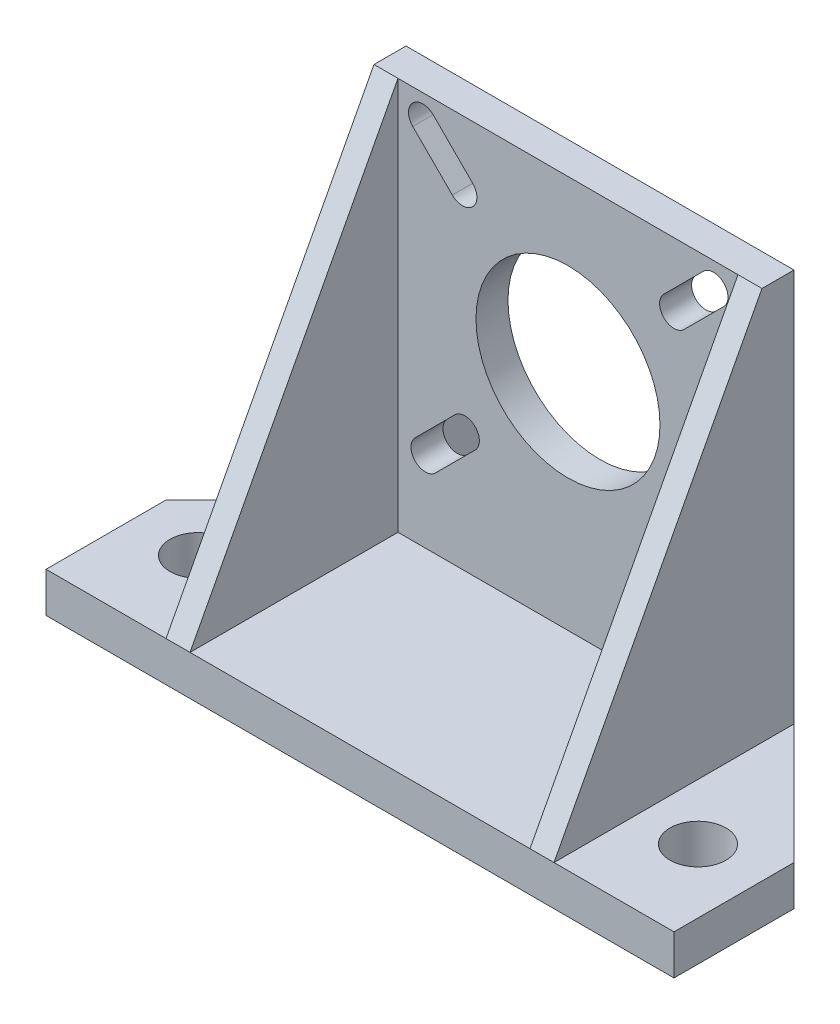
ISO-10303-21;
HEADER;
FILE_DESCRIPTION(('STEP AP214'),'2;1');
FILE_NAME('part.step','',(''),(''),'','','');
FILE_SCHEMA(('AUTOMOTIVE_DESIGN { 1 0 10303 214 1 1 1 1 }'));
ENDSEC;
DATA;
#1=APPLICATION_CONTEXT('core data for automotive mechanical design processes');
#2=APPLICATION_PROTOCOL_DEFINITION('international standard','automotive_design',2000,#1);
#3=PRODUCT_CONTEXT('',#1,'mechanical');
#4=PRODUCT('Part','Part','',(#3));
#5=PRODUCT_RELATED_PRODUCT_CATEGORY('part','',(#4));
#6=PRODUCT_DEFINITION_FORMATION('','',#4);
#7=PRODUCT_DEFINITION_CONTEXT('part definition',#1,'design');
#8=PRODUCT_DEFINITION('design','',#6,#7);
#9=PRODUCT_DEFINITION_SHAPE('','',#8);
#10=(LENGTH_UNIT() NAMED_UNIT(*) SI_UNIT(.MILLI.,.METRE.));
#11=(NAMED_UNIT(*) PLANE_ANGLE_UNIT() SI_UNIT($,.RADIAN.));
#12=(NAMED_UNIT(*) SI_UNIT($,.STERADIAN.) SOLID_ANGLE_UNIT());
#13=UNCERTAINTY_MEASURE_WITH_UNIT(LENGTH_MEASURE(1.E-05),#10,'distance_accuracy_value','');
#14=(GEOMETRIC_REPRESENTATION_CONTEXT(3) GLOBAL_UNCERTAINTY_ASSIGNED_CONTEXT((#13)) GLOBAL_UNIT_ASSIGNED_CONTEXT((#10,
#11,#12)) REPRESENTATION_CONTEXT('',''));
#15=CARTESIAN_POINT('',(0.,0.,0.));
#16=DIRECTION('',(0.,0.,1.));
#17=DIRECTION('',(1.,0.,0.));
#18=AXIS2_PLACEMENT_3D('',#15,#16,#17);
#19=CARTESIAN_POINT('',(0.,0.,-26.));
#20=DIRECTION('',(0.,0.,-1.));
#21=DIRECTION('',(-1.,0.,0.));
#22=AXIS2_PLACEMENT_3D('',#19,#20,#21);
#23=PLANE('',#22);
#24=DIRECTION('',(1.,0.,0.));
#25=VECTOR('',#24,1.);
#26=CARTESIAN_POINT('',(0.,5.,-26.));
#27=LINE('',#26,#25);
#28=CARTESIAN_POINT('',(18.,5.,-26.));
#29=VERTEX_POINT('',#28);
#30=CARTESIAN_POINT('',(60.5,5.,-26.));
#31=VERTEX_POINT('',#30);
#32=EDGE_CURVE('E318',#29,#31,#27,.T.);
#33=ORIENTED_EDGE('',*,*,#32,.T.);
#34=DIRECTION('',(0.,1.,0.));
#35=VECTOR('',#34,1.);
#36=CARTESIAN_POINT('',(60.5,0.,-26.));
#37=LINE('',#36,#35);
#38=CARTESIAN_POINT('',(60.5,54.15,-26.));
#39=VERTEX_POINT('',#38);
#40=EDGE_CURVE('E387',#39,#31,#37,.F.);
#41=ORIENTED_EDGE('',*,*,#40,.F.);
#42=DIRECTION('',(-1.,0.,0.));
#43=VECTOR('',#42,1.);
#44=CARTESIAN_POINT('',(15.,54.15,-26.));
#45=LINE('',#44,#43);
#46=CARTESIAN_POINT('',(18.,54.15,-26.));
#47=VERTEX_POINT('',#46);
#48=EDGE_CURVE('E330',#47,#39,#45,.F.);
#49=ORIENTED_EDGE('',*,*,#48,.F.);
#50=DIRECTION('',(0.,1.,0.));
#51=VECTOR('',#50,1.);
#52=CARTESIAN_POINT('',(18.,0.,-26.));
#53=LINE('',#52,#51);
#54=EDGE_CURVE('E390',#47,#29,#53,.F.);
#55=ORIENTED_EDGE('',*,*,#54,.T.);
#56=EDGE_LOOP('',(#33,#41,#49,#55));
#57=FACE_BOUND('',#56,.T.);
#58=CARTESIAN_POINT('',(39.25,33.,-26.));
#59=DIRECTION('',(0.,0.,1.));
#60=DIRECTION('',(1.,0.,0.));
#61=AXIS2_PLACEMENT_3D('',#58,#59,#60);
#62=CIRCLE('',#61,11.5);
#63=CARTESIAN_POINT('',(50.75,33.,-26.));
#64=VERTEX_POINT('',#63);
#65=EDGE_CURVE('E20',#64,#64,#62,.F.);
#66=ORIENTED_EDGE('',*,*,#65,.T.);
#67=EDGE_LOOP('',(#66));
#68=FACE_BOUND('',#67,.T.);
#69=DIRECTION('',(-0.707106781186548,0.707106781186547,0.));
#70=VECTOR('',#69,1.);
#71=CARTESIAN_POINT('',(27.3373806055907,47.4582038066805,-26.));
#72=LINE('',#71,#70);
#73=CARTESIAN_POINT('',(22.3876331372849,52.4079512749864,-26.));
#74=VERTEX_POINT('',#73);
#75=CARTESIAN_POINT('',(27.3373806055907,47.4582038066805,-26.));
#76=VERTEX_POINT('',#75);
#77=EDGE_CURVE('E382',#74,#76,#72,.F.);
#78=ORIENTED_EDGE('',*,*,#77,.T.);
#79=CARTESIAN_POINT('',(26.064588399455,46.1854116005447,-26.));
#80=DIRECTION('',(0.,0.,1.));
#81=DIRECTION('',(1.,0.,0.));
#82=AXIS2_PLACEMENT_3D('',#79,#80,#81);
#83=CIRCLE('',#82,1.8);
#84=CARTESIAN_POINT('',(24.7917961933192,44.912619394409,-26.));
#85=VERTEX_POINT('',#84);
#86=EDGE_CURVE('E376',#76,#85,#83,.F.);
#87=ORIENTED_EDGE('',*,*,#86,.T.);
#88=DIRECTION('',(0.707106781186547,-0.707106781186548,0.));
#89=VECTOR('',#88,1.);
#90=CARTESIAN_POINT('',(24.7917961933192,44.912619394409,-26.));
#91=LINE('',#90,#89);
#92=CARTESIAN_POINT('',(19.8420487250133,49.8623668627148,-26.));
#93=VERTEX_POINT('',#92);
#94=EDGE_CURVE('E375',#85,#93,#91,.F.);
#95=ORIENTED_EDGE('',*,*,#94,.T.);
#96=CARTESIAN_POINT('',(21.1148409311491,51.1351590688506,-26.));
#97=DIRECTION('',(0.,0.,1.));
#98=DIRECTION('',(1.,0.,0.));
#99=AXIS2_PLACEMENT_3D('',#96,#97,#98);
#100=CIRCLE('',#99,1.79999999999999);
#101=EDGE_CURVE('E383',#93,#74,#100,.F.);
#102=ORIENTED_EDGE('',*,*,#101,.T.);
#103=EDGE_LOOP('',(#78,#87,#95,#102));
#104=FACE_BOUND('',#103,.T.);
#105=CARTESIAN_POINT('',(52.4978955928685,46.1229276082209,-26.));
#106=DIRECTION('',(0.,0.,1.));
#107=DIRECTION('',(1.,0.,0.));
#108=AXIS2_PLACEMENT_3D('',#105,#106,#107);
#109=CIRCLE('',#108,1.8);
#110=CARTESIAN_POINT('',(53.7706877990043,44.8501354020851,-26.));
#111=VERTEX_POINT('',#110);
#112=CARTESIAN_POINT('',(51.2251033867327,47.3957198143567,-26.));
#113=VERTEX_POINT('',#112);
#114=EDGE_CURVE('E368',#111,#113,#109,.F.);
#115=ORIENTED_EDGE('',*,*,#114,.T.);
#116=DIRECTION('',(-0.707106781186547,-0.707106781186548,0.));
#117=VECTOR('',#116,1.);
#118=CARTESIAN_POINT('',(51.2251033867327,47.3957198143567,-26.));
#119=LINE('',#118,#117);
#120=CARTESIAN_POINT('',(56.1748508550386,52.3454672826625,-26.));
#121=VERTEX_POINT('',#120);
#122=EDGE_CURVE('E367',#113,#121,#119,.F.);
#123=ORIENTED_EDGE('',*,*,#122,.T.);
#124=CARTESIAN_POINT('',(57.4476430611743,51.0726750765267,-26.));
#125=DIRECTION('',(0.,0.,1.));
#126=DIRECTION('',(1.,0.,0.));
#127=AXIS2_PLACEMENT_3D('',#124,#125,#126);
#128=CIRCLE('',#127,1.8);
#129=CARTESIAN_POINT('',(58.7204352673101,49.799882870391,-26.));
#130=VERTEX_POINT('',#129);
#131=EDGE_CURVE('E249',#121,#130,#128,.F.);
#132=ORIENTED_EDGE('',*,*,#131,.T.);
#133=DIRECTION('',(0.707106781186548,0.707106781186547,0.));
#134=VECTOR('',#133,1.);
#135=CARTESIAN_POINT('',(53.7706877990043,44.8501354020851,-26.));
#136=LINE('',#135,#134);
#137=EDGE_CURVE('E248',#130,#111,#136,.F.);
#138=ORIENTED_EDGE('',*,*,#137,.T.);
#139=EDGE_LOOP('',(#115,#123,#132,#138));
#140=FACE_BOUND('',#139,.T.);
#141=CARTESIAN_POINT('',(52.1912361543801,20.0587638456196,-26.));
#142=DIRECTION('',(0.,0.,1.));
#143=DIRECTION('',(1.,0.,0.));
#144=AXIS2_PLACEMENT_3D('',#141,#142,#143);
#145=CIRCLE('',#144,1.79999999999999);
#146=CARTESIAN_POINT('',(50.9184439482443,18.7859716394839,-26.));
#147=VERTEX_POINT('',#146);
#148=CARTESIAN_POINT('',(53.4640283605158,21.3315560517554,-26.));
#149=VERTEX_POINT('',#148);
#150=EDGE_CURVE('E352',#147,#149,#145,.F.);
#151=ORIENTED_EDGE('',*,*,#150,.T.);
#152=DIRECTION('',(-0.707106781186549,0.707106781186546,0.));
#153=VECTOR('',#152,1.);
#154=CARTESIAN_POINT('',(53.4640283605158,21.3315560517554,-26.));
#155=LINE('',#154,#153);
#156=CARTESIAN_POINT('',(58.4137758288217,16.3818085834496,-26.));
#157=VERTEX_POINT('',#156);
#158=EDGE_CURVE('E351',#149,#157,#155,.F.);
#159=ORIENTED_EDGE('',*,*,#158,.T.);
#160=CARTESIAN_POINT('',(57.1409836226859,15.1090163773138,-26.));
#161=DIRECTION('',(0.,0.,1.));
#162=DIRECTION('',(1.,0.,0.));
#163=AXIS2_PLACEMENT_3D('',#160,#161,#162);
#164=CIRCLE('',#163,1.8);
#165=CARTESIAN_POINT('',(55.8681914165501,13.836224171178,-26.));
#166=VERTEX_POINT('',#165);
#167=EDGE_CURVE('E363',#157,#166,#164,.F.);
#168=ORIENTED_EDGE('',*,*,#167,.T.);
#169=DIRECTION('',(0.707106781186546,-0.707106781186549,0.));
#170=VECTOR('',#169,1.);
#171=CARTESIAN_POINT('',(50.9184439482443,18.7859716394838,-26.));
#172=LINE('',#171,#170);
#173=EDGE_CURVE('E359',#166,#147,#172,.F.);
#174=ORIENTED_EDGE('',*,*,#173,.T.);
#175=EDGE_LOOP('',(#151,#159,#168,#174));
#176=FACE_BOUND('',#175,.T.);
#177=CARTESIAN_POINT('',(26.3712478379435,19.9962798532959,-26.));
#178=DIRECTION('',(0.,0.,1.));
#179=DIRECTION('',(1.,0.,0.));
#180=AXIS2_PLACEMENT_3D('',#177,#178,#179);
#181=CIRCLE('',#180,1.8);
#182=CARTESIAN_POINT('',(25.0984556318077,21.2690720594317,-26.));
#183=VERTEX_POINT('',#182);
#184=CARTESIAN_POINT('',(27.6440400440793,18.7234876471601,-26.));
#185=VERTEX_POINT('',#184);
#186=EDGE_CURVE('E338',#183,#185,#181,.F.);
#187=ORIENTED_EDGE('',*,*,#186,.T.);
#188=DIRECTION('',(0.707106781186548,0.707106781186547,0.));
#189=VECTOR('',#188,1.);
#190=CARTESIAN_POINT('',(27.6440400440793,18.7234876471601,-26.));
#191=LINE('',#190,#189);
#192=CARTESIAN_POINT('',(22.6942925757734,13.7737401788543,-26.));
#193=VERTEX_POINT('',#192);
#194=EDGE_CURVE('E337',#185,#193,#191,.F.);
#195=ORIENTED_EDGE('',*,*,#194,.T.);
#196=CARTESIAN_POINT('',(21.4215003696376,15.04653238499,-26.));
#197=DIRECTION('',(0.,0.,1.));
#198=DIRECTION('',(1.,0.,0.));
#199=AXIS2_PLACEMENT_3D('',#196,#197,#198);
#200=CIRCLE('',#199,1.8);
#201=CARTESIAN_POINT('',(20.1487081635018,16.3193245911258,-26.));
#202=VERTEX_POINT('',#201);
#203=EDGE_CURVE('E347',#193,#202,#200,.F.);
#204=ORIENTED_EDGE('',*,*,#203,.T.);
#205=DIRECTION('',(-0.707106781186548,-0.707106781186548,0.));
#206=VECTOR('',#205,1.);
#207=CARTESIAN_POINT('',(25.0984556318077,21.2690720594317,-26.));
#208=LINE('',#207,#206);
#209=EDGE_CURVE('E343',#202,#183,#208,.F.);
#210=ORIENTED_EDGE('',*,*,#209,.T.);
#211=EDGE_LOOP('',(#187,#195,#204,#210));
#212=FACE_BOUND('',#211,.T.);
#213=ADVANCED_FACE('F17',(#57,#68,#104,#140,#176,#212),#23,.F.);
#214=CARTESIAN_POINT('',(18.,0.,0.));
#215=DIRECTION('',(-1.,0.,0.));
#216=DIRECTION('',(0.,0.,1.));
#217=AXIS2_PLACEMENT_3D('',#214,#215,#216);
#218=PLANE('',#217);
#219=DIRECTION('',(0.,-0.883940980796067,0.467598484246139));
#220=VECTOR('',#219,1.);
#221=CARTESIAN_POINT('',(18.,54.15,-26.));
#222=LINE('',#221,#220);
#223=CARTESIAN_POINT('',(18.,5.,0.));
#224=VERTEX_POINT('',#223);
#225=EDGE_CURVE('E322',#224,#47,#222,.F.);
#226=ORIENTED_EDGE('',*,*,#225,.F.);
#227=DIRECTION('',(0.,0.,-1.));
#228=VECTOR('',#227,1.);
#229=CARTESIAN_POINT('',(18.,5.,0.));
#230=LINE('',#229,#228);
#231=EDGE_CURVE('E313',#224,#29,#230,.T.);
#232=ORIENTED_EDGE('',*,*,#231,.T.);
#233=ORIENTED_EDGE('',*,*,#54,.F.);
#234=EDGE_LOOP('',(#226,#232,#233));
#235=FACE_BOUND('',#234,.T.);
#236=ADVANCED_FACE('F461',(#235),#218,.F.);
#237=CARTESIAN_POINT('',(60.5,0.,0.));
#238=DIRECTION('',(-1.,0.,0.));
#239=DIRECTION('',(0.,0.,1.));
#240=AXIS2_PLACEMENT_3D('',#237,#238,#239);
#241=PLANE('',#240);
#242=DIRECTION('',(0.,0.,-1.));
#243=VECTOR('',#242,1.);
#244=CARTESIAN_POINT('',(60.5,5.,0.));
#245=LINE('',#244,#243);
#246=CARTESIAN_POINT('',(60.5,5.,0.));
#247=VERTEX_POINT('',#246);
#248=EDGE_CURVE('E316',#31,#247,#245,.F.);
#249=ORIENTED_EDGE('',*,*,#248,.T.);
#250=DIRECTION('',(0.,-0.883940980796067,0.467598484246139));
#251=VECTOR('',#250,1.);
#252=CARTESIAN_POINT('',(60.5,54.15,-26.));
#253=LINE('',#252,#251);
#254=EDGE_CURVE('E304',#39,#247,#253,.T.);
#255=ORIENTED_EDGE('',*,*,#254,.F.);
#256=ORIENTED_EDGE('',*,*,#40,.T.);
#257=EDGE_LOOP('',(#249,#255,#256));
#258=FACE_BOUND('',#257,.T.);
#259=ADVANCED_FACE('F450',(#258),#241,.T.);
#260=CARTESIAN_POINT('',(39.25,33.,-36.));
#261=DIRECTION('',(0.,0.,1.));
#262=DIRECTION('',(1.,0.,0.));
#263=AXIS2_PLACEMENT_3D('',#260,#261,#262);
#264=CYLINDRICAL_SURFACE('',#263,11.5);
#265=CARTESIAN_POINT('',(39.25,33.,-30.));
#266=DIRECTION('',(0.,0.,1.));
#267=DIRECTION('',(1.,0.,0.));
#268=AXIS2_PLACEMENT_3D('',#265,#266,#267);
#269=CIRCLE('',#268,11.5);
#270=CARTESIAN_POINT('',(50.75,33.,-30.));
#271=VERTEX_POINT('',#270);
#272=EDGE_CURVE('E271',#271,#271,#269,.F.);
#273=ORIENTED_EDGE('',*,*,#272,.T.);
#274=EDGE_LOOP('',(#273));
#275=FACE_BOUND('',#274,.T.);
#276=ORIENTED_EDGE('',*,*,#65,.F.);
#277=EDGE_LOOP('',(#276));
#278=FACE_BOUND('',#277,.T.);
#279=ADVANCED_FACE('F447',(#275,#278),#264,.F.);
#280=CARTESIAN_POINT('',(21.1148409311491,51.1351590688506,-36.));
#281=DIRECTION('',(0.,0.,1.));
#282=DIRECTION('',(1.,0.,0.));
#283=AXIS2_PLACEMENT_3D('',#280,#281,#282);
#284=CYLINDRICAL_SURFACE('',#283,1.79999999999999);
#285=ORIENTED_EDGE('',*,*,#101,.F.);
#286=DIRECTION('',(0.,0.,1.));
#287=VECTOR('',#286,1.);
#288=CARTESIAN_POINT('',(19.8420487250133,49.8623668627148,-36.));
#289=LINE('',#288,#287);
#290=CARTESIAN_POINT('',(19.8420487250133,49.8623668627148,-30.));
#291=VERTEX_POINT('',#290);
#292=EDGE_CURVE('E377',#93,#291,#289,.F.);
#293=ORIENTED_EDGE('',*,*,#292,.T.);
#294=CARTESIAN_POINT('',(21.1148409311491,51.1351590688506,-30.));
#295=DIRECTION('',(0.,0.,1.));
#296=DIRECTION('',(1.,0.,0.));
#297=AXIS2_PLACEMENT_3D('',#294,#295,#296);
#298=CIRCLE('',#297,1.79999999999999);
#299=CARTESIAN_POINT('',(22.3876331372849,52.4079512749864,-30.));
#300=VERTEX_POINT('',#299);
#301=EDGE_CURVE('E267',#291,#300,#298,.F.);
#302=ORIENTED_EDGE('',*,*,#301,.T.);
#303=DIRECTION('',(0.,0.,1.));
#304=VECTOR('',#303,1.);
#305=CARTESIAN_POINT('',(22.3876331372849,52.4079512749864,-36.));
#306=LINE('',#305,#304);
#307=EDGE_CURVE('E379',#300,#74,#306,.T.);
#308=ORIENTED_EDGE('',*,*,#307,.T.);
#309=EDGE_LOOP('',(#285,#293,#302,#308));
#310=FACE_BOUND('',#309,.T.);
#311=ADVANCED_FACE('F449',(#310),#284,.F.);
#312=CARTESIAN_POINT('',(27.3373806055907,47.4582038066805,-36.));
#313=DIRECTION('',(0.707106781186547,0.707106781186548,0.));
#314=DIRECTION('',(-0.707106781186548,0.707106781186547,0.));
#315=AXIS2_PLACEMENT_3D('',#312,#313,#314);
#316=PLANE('',#315);
#317=ORIENTED_EDGE('',*,*,#77,.F.);
#318=ORIENTED_EDGE('',*,*,#307,.F.);
#319=DIRECTION('',(0.707106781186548,-0.707106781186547,0.));
#320=VECTOR('',#319,1.);
#321=CARTESIAN_POINT('',(22.3876331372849,52.4079512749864,-30.));
#322=LINE('',#321,#320);
#323=CARTESIAN_POINT('',(27.3373806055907,47.4582038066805,-30.));
#324=VERTEX_POINT('',#323);
#325=EDGE_CURVE('E264',#300,#324,#322,.T.);
#326=ORIENTED_EDGE('',*,*,#325,.T.);
#327=DIRECTION('',(0.,0.,1.));
#328=VECTOR('',#327,1.);
#329=CARTESIAN_POINT('',(27.3373806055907,47.4582038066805,-36.));
#330=LINE('',#329,#328);
#331=EDGE_CURVE('E384',#76,#324,#330,.F.);
#332=ORIENTED_EDGE('',*,*,#331,.F.);
#333=EDGE_LOOP('',(#317,#318,#326,#332));
#334=FACE_BOUND('',#333,.T.);
#335=ADVANCED_FACE('F458',(#334),#316,.F.);
#336=CARTESIAN_POINT('',(26.064588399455,46.1854116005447,-36.));
#337=DIRECTION('',(0.,0.,1.));
#338=DIRECTION('',(1.,0.,0.));
#339=AXIS2_PLACEMENT_3D('',#336,#337,#338);
#340=CYLINDRICAL_SURFACE('',#339,1.8);
#341=CARTESIAN_POINT('',(26.064588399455,46.1854116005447,-30.));
#342=DIRECTION('',(0.,0.,1.));
#343=DIRECTION('',(1.,0.,0.));
#344=AXIS2_PLACEMENT_3D('',#341,#342,#343);
#345=CIRCLE('',#344,1.8);
#346=CARTESIAN_POINT('',(24.7917961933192,44.912619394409,-30.));
#347=VERTEX_POINT('',#346);
#348=EDGE_CURVE('E263',#324,#347,#345,.F.);
#349=ORIENTED_EDGE('',*,*,#348,.T.);
#350=DIRECTION('',(0.,0.,1.));
#351=VECTOR('',#350,1.);
#352=CARTESIAN_POINT('',(24.7917961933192,44.912619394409,-36.));
#353=LINE('',#352,#351);
#354=EDGE_CURVE('E372',#347,#85,#353,.T.);
#355=ORIENTED_EDGE('',*,*,#354,.T.);
#356=ORIENTED_EDGE('',*,*,#86,.F.);
#357=ORIENTED_EDGE('',*,*,#331,.T.);
#358=EDGE_LOOP('',(#349,#355,#356,#357));
#359=FACE_BOUND('',#358,.T.);
#360=ADVANCED_FACE('F605',(#359),#340,.F.);
#361=CARTESIAN_POINT('',(24.7917961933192,44.912619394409,-36.));
#362=DIRECTION('',(-0.707106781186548,-0.707106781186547,0.));
#363=DIRECTION('',(0.707106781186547,-0.707106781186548,0.));
#364=AXIS2_PLACEMENT_3D('',#361,#362,#363);
#365=PLANE('',#364);
#366=ORIENTED_EDGE('',*,*,#94,.F.);
#367=ORIENTED_EDGE('',*,*,#354,.F.);
#368=DIRECTION('',(-0.707106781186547,0.707106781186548,0.));
#369=VECTOR('',#368,1.);
#370=CARTESIAN_POINT('',(24.7917961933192,44.912619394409,-30.));
#371=LINE('',#370,#369);
#372=EDGE_CURVE('E242',#347,#291,#371,.T.);
#373=ORIENTED_EDGE('',*,*,#372,.T.);
#374=ORIENTED_EDGE('',*,*,#292,.F.);
#375=EDGE_LOOP('',(#366,#367,#373,#374));
#376=FACE_BOUND('',#375,.T.);
#377=ADVANCED_FACE('F602',(#376),#365,.F.);
#378=CARTESIAN_POINT('',(57.4476430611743,51.0726750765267,-36.));
#379=DIRECTION('',(0.,0.,1.));
#380=DIRECTION('',(1.,0.,0.));
#381=AXIS2_PLACEMENT_3D('',#378,#379,#380);
#382=CYLINDRICAL_SURFACE('',#381,1.8);
#383=CARTESIAN_POINT('',(57.4476430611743,51.0726750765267,-30.));
#384=DIRECTION('',(0.,0.,1.));
#385=DIRECTION('',(1.,0.,0.));
#386=AXIS2_PLACEMENT_3D('',#383,#384,#385);
#387=CIRCLE('',#386,1.8);
#388=CARTESIAN_POINT('',(56.1748508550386,52.3454672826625,-30.));
#389=VERTEX_POINT('',#388);
#390=CARTESIAN_POINT('',(58.7204352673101,49.799882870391,-30.));
#391=VERTEX_POINT('',#390);
#392=EDGE_CURVE('E229',#389,#391,#387,.F.);
#393=ORIENTED_EDGE('',*,*,#392,.T.);
#394=DIRECTION('',(0.,0.,1.));
#395=VECTOR('',#394,1.);
#396=CARTESIAN_POINT('',(58.7204352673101,49.799882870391,-36.));
#397=LINE('',#396,#395);
#398=EDGE_CURVE('E233',#391,#130,#397,.T.);
#399=ORIENTED_EDGE('',*,*,#398,.T.);
#400=ORIENTED_EDGE('',*,*,#131,.F.);
#401=DIRECTION('',(0.,0.,1.));
#402=VECTOR('',#401,1.);
#403=CARTESIAN_POINT('',(56.1748508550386,52.3454672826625,-36.));
#404=LINE('',#403,#402);
#405=EDGE_CURVE('E236',#121,#389,#404,.F.);
#406=ORIENTED_EDGE('',*,*,#405,.T.);
#407=EDGE_LOOP('',(#393,#399,#400,#406));
#408=FACE_BOUND('',#407,.T.);
#409=ADVANCED_FACE('F231',(#408),#382,.F.);
#410=CARTESIAN_POINT('',(53.7706877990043,44.8501354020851,-36.));
#411=DIRECTION('',(0.707106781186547,-0.707106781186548,0.));
#412=DIRECTION('',(0.707106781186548,0.707106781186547,0.));
#413=AXIS2_PLACEMENT_3D('',#410,#411,#412);
#414=PLANE('',#413);
#415=ORIENTED_EDGE('',*,*,#137,.F.);
#416=ORIENTED_EDGE('',*,*,#398,.F.);
#417=DIRECTION('',(-0.707106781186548,-0.707106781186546,0.));
#418=VECTOR('',#417,1.);
#419=CARTESIAN_POINT('',(58.7204352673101,49.799882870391,-30.));
#420=LINE('',#419,#418);
#421=CARTESIAN_POINT('',(53.7706877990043,44.8501354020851,-30.));
#422=VERTEX_POINT('',#421);
#423=EDGE_CURVE('E241',#391,#422,#420,.T.);
#424=ORIENTED_EDGE('',*,*,#423,.T.);
#425=DIRECTION('',(0.,0.,1.));
#426=VECTOR('',#425,1.);
#427=CARTESIAN_POINT('',(53.7706877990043,44.8501354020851,-36.));
#428=LINE('',#427,#426);
#429=EDGE_CURVE('E370',#422,#111,#428,.T.);
#430=ORIENTED_EDGE('',*,*,#429,.T.);
#431=EDGE_LOOP('',(#415,#416,#424,#430));
#432=FACE_BOUND('',#431,.T.);
#433=ADVANCED_FACE('F245',(#432),#414,.F.);
#434=CARTESIAN_POINT('',(52.4978955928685,46.1229276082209,-36.));
#435=DIRECTION('',(0.,0.,1.));
#436=DIRECTION('',(1.,0.,0.));
#437=AXIS2_PLACEMENT_3D('',#434,#435,#436);
#438=CYLINDRICAL_SURFACE('',#437,1.8);
#439=ORIENTED_EDGE('',*,*,#114,.F.);
#440=ORIENTED_EDGE('',*,*,#429,.F.);
#441=CARTESIAN_POINT('',(52.4978955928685,46.1229276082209,-30.));
#442=DIRECTION('',(0.,0.,1.));
#443=DIRECTION('',(1.,0.,0.));
#444=AXIS2_PLACEMENT_3D('',#441,#442,#443);
#445=CIRCLE('',#444,1.8);
#446=CARTESIAN_POINT('',(51.2251033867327,47.3957198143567,-30.));
#447=VERTEX_POINT('',#446);
#448=EDGE_CURVE('E254',#422,#447,#445,.F.);
#449=ORIENTED_EDGE('',*,*,#448,.T.);
#450=DIRECTION('',(0.,0.,1.));
#451=VECTOR('',#450,1.);
#452=CARTESIAN_POINT('',(51.2251033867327,47.3957198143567,-36.));
#453=LINE('',#452,#451);
#454=EDGE_CURVE('E364',#447,#113,#453,.T.);
#455=ORIENTED_EDGE('',*,*,#454,.T.);
#456=EDGE_LOOP('',(#439,#440,#449,#455));
#457=FACE_BOUND('',#456,.T.);
#458=ADVANCED_FACE('F593',(#457),#438,.F.);
#459=CARTESIAN_POINT('',(51.2251033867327,47.3957198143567,-36.));
#460=DIRECTION('',(-0.707106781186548,0.707106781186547,0.));
#461=DIRECTION('',(-0.707106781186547,-0.707106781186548,0.));
#462=AXIS2_PLACEMENT_3D('',#459,#460,#461);
#463=PLANE('',#462);
#464=ORIENTED_EDGE('',*,*,#122,.F.);
#465=ORIENTED_EDGE('',*,*,#454,.F.);
#466=DIRECTION('',(0.707106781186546,0.707106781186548,0.));
#467=VECTOR('',#466,1.);
#468=CARTESIAN_POINT('',(51.2251033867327,47.3957198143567,-30.));
#469=LINE('',#468,#467);
#470=EDGE_CURVE('E256',#447,#389,#469,.T.);
#471=ORIENTED_EDGE('',*,*,#470,.T.);
#472=ORIENTED_EDGE('',*,*,#405,.F.);
#473=EDGE_LOOP('',(#464,#465,#471,#472));
#474=FACE_BOUND('',#473,.T.);
#475=ADVANCED_FACE('F589',(#474),#463,.F.);
#476=CARTESIAN_POINT('',(57.1409836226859,15.1090163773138,-36.));
#477=DIRECTION('',(0.,0.,1.));
#478=DIRECTION('',(1.,0.,0.));
#479=AXIS2_PLACEMENT_3D('',#476,#477,#478);
#480=CYLINDRICAL_SURFACE('',#479,1.8);
#481=CARTESIAN_POINT('',(57.1409836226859,15.1090163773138,-30.));
#482=DIRECTION('',(0.,0.,1.));
#483=DIRECTION('',(1.,0.,0.));
#484=AXIS2_PLACEMENT_3D('',#481,#482,#483);
#485=CIRCLE('',#484,1.8);
#486=CARTESIAN_POINT('',(58.4137758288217,16.3818085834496,-30.));
#487=VERTEX_POINT('',#486);
#488=CARTESIAN_POINT('',(55.8681914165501,13.836224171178,-30.));
#489=VERTEX_POINT('',#488);
#490=EDGE_CURVE('E429',#487,#489,#485,.F.);
#491=ORIENTED_EDGE('',*,*,#490,.T.);
#492=DIRECTION('',(0.,0.,1.));
#493=VECTOR('',#492,1.);
#494=CARTESIAN_POINT('',(55.8681914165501,13.836224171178,-36.));
#495=LINE('',#494,#493);
#496=EDGE_CURVE('E360',#489,#166,#495,.T.);
#497=ORIENTED_EDGE('',*,*,#496,.T.);
#498=ORIENTED_EDGE('',*,*,#167,.F.);
#499=DIRECTION('',(0.,0.,1.));
#500=VECTOR('',#499,1.);
#501=CARTESIAN_POINT('',(58.4137758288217,16.3818085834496,-36.));
#502=LINE('',#501,#500);
#503=EDGE_CURVE('E353',#157,#487,#502,.F.);
#504=ORIENTED_EDGE('',*,*,#503,.T.);
#505=EDGE_LOOP('',(#491,#497,#498,#504));
#506=FACE_BOUND('',#505,.T.);
#507=ADVANCED_FACE('F585',(#506),#480,.F.);
#508=CARTESIAN_POINT('',(50.9184439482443,18.7859716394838,-36.));
#509=DIRECTION('',(-0.707106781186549,-0.707106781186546,0.));
#510=DIRECTION('',(0.707106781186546,-0.707106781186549,0.));
#511=AXIS2_PLACEMENT_3D('',#508,#509,#510);
#512=PLANE('',#511);
#513=ORIENTED_EDGE('',*,*,#173,.F.);
#514=ORIENTED_EDGE('',*,*,#496,.F.);
#515=DIRECTION('',(-0.707106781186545,0.70710678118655,0.));
#516=VECTOR('',#515,1.);
#517=CARTESIAN_POINT('',(55.8681914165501,13.836224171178,-30.));
#518=LINE('',#517,#516);
#519=CARTESIAN_POINT('',(50.9184439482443,18.7859716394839,-30.));
#520=VERTEX_POINT('',#519);
#521=EDGE_CURVE('E428',#489,#520,#518,.T.);
#522=ORIENTED_EDGE('',*,*,#521,.T.);
#523=DIRECTION('',(0.,0.,1.));
#524=VECTOR('',#523,1.);
#525=CARTESIAN_POINT('',(50.9184439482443,18.7859716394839,-36.));
#526=LINE('',#525,#524);
#527=EDGE_CURVE('E356',#520,#147,#526,.T.);
#528=ORIENTED_EDGE('',*,*,#527,.T.);
#529=EDGE_LOOP('',(#513,#514,#522,#528));
#530=FACE_BOUND('',#529,.T.);
#531=ADVANCED_FACE('F581',(#530),#512,.F.);
#532=CARTESIAN_POINT('',(52.1912361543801,20.0587638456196,-36.));
#533=DIRECTION('',(0.,0.,1.));
#534=DIRECTION('',(1.,0.,0.));
#535=AXIS2_PLACEMENT_3D('',#532,#533,#534);
#536=CYLINDRICAL_SURFACE('',#535,1.79999999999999);
#537=ORIENTED_EDGE('',*,*,#150,.F.);
#538=ORIENTED_EDGE('',*,*,#527,.F.);
#539=CARTESIAN_POINT('',(52.1912361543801,20.0587638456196,-30.));
#540=DIRECTION('',(0.,0.,1.));
#541=DIRECTION('',(1.,0.,0.));
#542=AXIS2_PLACEMENT_3D('',#539,#540,#541);
#543=CIRCLE('',#542,1.79999999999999);
#544=CARTESIAN_POINT('',(53.4640283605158,21.3315560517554,-30.));
#545=VERTEX_POINT('',#544);
#546=EDGE_CURVE('E426',#520,#545,#543,.F.);
#547=ORIENTED_EDGE('',*,*,#546,.T.);
#548=DIRECTION('',(0.,0.,1.));
#549=VECTOR('',#548,1.);
#550=CARTESIAN_POINT('',(53.4640283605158,21.3315560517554,-36.));
#551=LINE('',#550,#549);
#552=EDGE_CURVE('E348',#545,#149,#551,.T.);
#553=ORIENTED_EDGE('',*,*,#552,.T.);
#554=EDGE_LOOP('',(#537,#538,#547,#553));
#555=FACE_BOUND('',#554,.T.);
#556=ADVANCED_FACE('F577',(#555),#536,.F.);
#557=CARTESIAN_POINT('',(53.4640283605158,21.3315560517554,-36.));
#558=DIRECTION('',(0.707106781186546,0.707106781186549,0.));
#559=DIRECTION('',(-0.707106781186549,0.707106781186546,0.));
#560=AXIS2_PLACEMENT_3D('',#557,#558,#559);
#561=PLANE('',#560);
#562=ORIENTED_EDGE('',*,*,#158,.F.);
#563=ORIENTED_EDGE('',*,*,#552,.F.);
#564=DIRECTION('',(0.707106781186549,-0.707106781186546,0.));
#565=VECTOR('',#564,1.);
#566=CARTESIAN_POINT('',(53.4640283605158,21.3315560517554,-30.));
#567=LINE('',#566,#565);
#568=EDGE_CURVE('E425',#545,#487,#567,.T.);
#569=ORIENTED_EDGE('',*,*,#568,.T.);
#570=ORIENTED_EDGE('',*,*,#503,.F.);
#571=EDGE_LOOP('',(#562,#563,#569,#570));
#572=FACE_BOUND('',#571,.T.);
#573=ADVANCED_FACE('F573',(#572),#561,.F.);
#574=CARTESIAN_POINT('',(21.4215003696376,15.04653238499,-36.));
#575=DIRECTION('',(0.,0.,1.));
#576=DIRECTION('',(1.,0.,0.));
#577=AXIS2_PLACEMENT_3D('',#574,#575,#576);
#578=CYLINDRICAL_SURFACE('',#577,1.8);
#579=ORIENTED_EDGE('',*,*,#203,.F.);
#580=DIRECTION('',(0.,0.,1.));
#581=VECTOR('',#580,1.);
#582=CARTESIAN_POINT('',(22.6942925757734,13.7737401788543,-36.));
#583=LINE('',#582,#581);
#584=CARTESIAN_POINT('',(22.6942925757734,13.7737401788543,-30.));
#585=VERTEX_POINT('',#584);
#586=EDGE_CURVE('E333',#193,#585,#583,.F.);
#587=ORIENTED_EDGE('',*,*,#586,.T.);
#588=CARTESIAN_POINT('',(21.4215003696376,15.04653238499,-30.));
#589=DIRECTION('',(0.,0.,1.));
#590=DIRECTION('',(1.,0.,0.));
#591=AXIS2_PLACEMENT_3D('',#588,#589,#590);
#592=CIRCLE('',#591,1.8);
#593=CARTESIAN_POINT('',(20.1487081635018,16.3193245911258,-30.));
#594=VERTEX_POINT('',#593);
#595=EDGE_CURVE('E423',#585,#594,#592,.F.);
#596=ORIENTED_EDGE('',*,*,#595,.T.);
#597=DIRECTION('',(0.,0.,1.));
#598=VECTOR('',#597,1.);
#599=CARTESIAN_POINT('',(20.1487081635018,16.3193245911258,-36.));
#600=LINE('',#599,#598);
#601=EDGE_CURVE('E344',#594,#202,#600,.T.);
#602=ORIENTED_EDGE('',*,*,#601,.T.);
#603=EDGE_LOOP('',(#579,#587,#596,#602));
#604=FACE_BOUND('',#603,.T.);
#605=ADVANCED_FACE('F569',(#604),#578,.F.);
#606=CARTESIAN_POINT('',(25.0984556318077,21.2690720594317,-36.));
#607=DIRECTION('',(-0.707106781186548,0.707106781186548,0.));
#608=DIRECTION('',(-0.707106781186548,-0.707106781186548,0.));
#609=AXIS2_PLACEMENT_3D('',#606,#607,#608);
#610=PLANE('',#609);
#611=ORIENTED_EDGE('',*,*,#209,.F.);
#612=ORIENTED_EDGE('',*,*,#601,.F.);
#613=DIRECTION('',(0.707106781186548,0.707106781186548,0.));
#614=VECTOR('',#613,1.);
#615=CARTESIAN_POINT('',(20.1487081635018,16.3193245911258,-30.));
#616=LINE('',#615,#614);
#617=CARTESIAN_POINT('',(25.0984556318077,21.2690720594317,-30.));
#618=VERTEX_POINT('',#617);
#619=EDGE_CURVE('E422',#594,#618,#616,.T.);
#620=ORIENTED_EDGE('',*,*,#619,.T.);
#621=DIRECTION('',(0.,0.,1.));
#622=VECTOR('',#621,1.);
#623=CARTESIAN_POINT('',(25.0984556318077,21.2690720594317,-36.));
#624=LINE('',#623,#622);
#625=EDGE_CURVE('E340',#618,#183,#624,.T.);
#626=ORIENTED_EDGE('',*,*,#625,.T.);
#627=EDGE_LOOP('',(#611,#612,#620,#626));
#628=FACE_BOUND('',#627,.T.);
#629=ADVANCED_FACE('F565',(#628),#610,.F.);
#630=CARTESIAN_POINT('',(26.3712478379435,19.9962798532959,-36.));
#631=DIRECTION('',(0.,0.,1.));
#632=DIRECTION('',(1.,0.,0.));
#633=AXIS2_PLACEMENT_3D('',#630,#631,#632);
#634=CYLINDRICAL_SURFACE('',#633,1.8);
#635=CARTESIAN_POINT('',(26.3712478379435,19.9962798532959,-30.));
#636=DIRECTION('',(0.,0.,1.));
#637=DIRECTION('',(1.,0.,0.));
#638=AXIS2_PLACEMENT_3D('',#635,#636,#637);
#639=CIRCLE('',#638,1.8);
#640=CARTESIAN_POINT('',(27.6440400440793,18.7234876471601,-30.));
#641=VERTEX_POINT('',#640);
#642=EDGE_CURVE('E419',#618,#641,#639,.F.);
#643=ORIENTED_EDGE('',*,*,#642,.T.);
#644=DIRECTION('',(0.,0.,1.));
#645=VECTOR('',#644,1.);
#646=CARTESIAN_POINT('',(27.6440400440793,18.7234876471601,-36.));
#647=LINE('',#646,#645);
#648=EDGE_CURVE('E334',#641,#185,#647,.T.);
#649=ORIENTED_EDGE('',*,*,#648,.T.);
#650=ORIENTED_EDGE('',*,*,#186,.F.);
#651=ORIENTED_EDGE('',*,*,#625,.F.);
#652=EDGE_LOOP('',(#643,#649,#650,#651));
#653=FACE_BOUND('',#652,.T.);
#654=ADVANCED_FACE('F561',(#653),#634,.F.);
#655=CARTESIAN_POINT('',(27.6440400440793,18.7234876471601,-36.));
#656=DIRECTION('',(0.707106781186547,-0.707106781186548,0.));
#657=DIRECTION('',(0.707106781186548,0.707106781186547,0.));
#658=AXIS2_PLACEMENT_3D('',#655,#656,#657);
#659=PLANE('',#658);
#660=ORIENTED_EDGE('',*,*,#194,.F.);
#661=ORIENTED_EDGE('',*,*,#648,.F.);
#662=DIRECTION('',(-0.707106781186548,-0.707106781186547,0.));
#663=VECTOR('',#662,1.);
#664=CARTESIAN_POINT('',(27.6440400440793,18.7234876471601,-30.));
#665=LINE('',#664,#663);
#666=EDGE_CURVE('E421',#641,#585,#665,.T.);
#667=ORIENTED_EDGE('',*,*,#666,.T.);
#668=ORIENTED_EDGE('',*,*,#586,.F.);
#669=EDGE_LOOP('',(#660,#661,#667,#668));
#670=FACE_BOUND('',#669,.T.);
#671=ADVANCED_FACE('F557',(#670),#659,.F.);
#672=CARTESIAN_POINT('',(17.5,0.,0.));
#673=DIRECTION('',(1.,0.,0.));
#674=DIRECTION('',(0.,0.,-1.));
#675=AXIS2_PLACEMENT_3D('',#672,#673,#674);
#676=PLANE('',#675);
#677=DIRECTION('',(0.,-0.707106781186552,-0.707106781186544));
#678=VECTOR('',#677,1.);
#679=CARTESIAN_POINT('',(17.5,4.,-45.));
#680=LINE('',#679,#678);
#681=CARTESIAN_POINT('',(17.5,4.,-45.));
#682=VERTEX_POINT('',#681);
#683=CARTESIAN_POINT('',(17.5,19.0000000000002,-30.));
#684=VERTEX_POINT('',#683);
#685=EDGE_CURVE('E325',#682,#684,#680,.F.);
#686=ORIENTED_EDGE('',*,*,#685,.T.);
#687=DIRECTION('',(0.,1.,0.));
#688=VECTOR('',#687,1.);
#689=CARTESIAN_POINT('',(17.5,5.,-30.));
#690=LINE('',#689,#688);
#691=CARTESIAN_POINT('',(17.5,4.,-30.));
#692=VERTEX_POINT('',#691);
#693=EDGE_CURVE('E648',#684,#692,#690,.F.);
#694=ORIENTED_EDGE('',*,*,#693,.T.);
#695=DIRECTION('',(0.,0.,1.));
#696=VECTOR('',#695,1.);
#697=CARTESIAN_POINT('',(17.5,4.,-45.));
#698=LINE('',#697,#696);
#699=EDGE_CURVE('E302',#692,#682,#698,.F.);
#700=ORIENTED_EDGE('',*,*,#699,.T.);
#701=EDGE_LOOP('',(#686,#694,#700));
#702=FACE_BOUND('',#701,.T.);
#703=ADVANCED_FACE('F553',(#702),#676,.T.);
#704=CARTESIAN_POINT('',(63.5,0.,-26.));
#705=DIRECTION('',(1.,0.,0.));
#706=DIRECTION('',(0.,0.,-1.));
#707=AXIS2_PLACEMENT_3D('',#704,#705,#706);
#708=PLANE('',#707);
#709=DIRECTION('',(0.,0.,1.));
#710=VECTOR('',#709,1.);
#711=CARTESIAN_POINT('',(63.5,54.15,-26.));
#712=LINE('',#711,#710);
#713=CARTESIAN_POINT('',(63.5,54.15,-26.));
#714=VERTEX_POINT('',#713);
#715=CARTESIAN_POINT('',(63.5,54.15,-30.));
#716=VERTEX_POINT('',#715);
#717=EDGE_CURVE('E327',#714,#716,#712,.F.);
#718=ORIENTED_EDGE('',*,*,#717,.F.);
#719=DIRECTION('',(0.,-0.883940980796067,0.467598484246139));
#720=VECTOR('',#719,1.);
#721=CARTESIAN_POINT('',(63.5,54.15,-26.));
#722=LINE('',#721,#720);
#723=CARTESIAN_POINT('',(63.5,5.,0.));
#724=VERTEX_POINT('',#723);
#725=EDGE_CURVE('E310',#724,#714,#722,.F.);
#726=ORIENTED_EDGE('',*,*,#725,.F.);
#727=DIRECTION('',(0.,0.,-1.));
#728=VECTOR('',#727,1.);
#729=CARTESIAN_POINT('',(63.5,5.,0.));
#730=LINE('',#729,#728);
#731=CARTESIAN_POINT('',(63.5,5.,-30.));
#732=VERTEX_POINT('',#731);
#733=EDGE_CURVE('E300',#724,#732,#730,.T.);
#734=ORIENTED_EDGE('',*,*,#733,.T.);
#735=DIRECTION('',(0.,1.,0.));
#736=VECTOR('',#735,1.);
#737=CARTESIAN_POINT('',(63.5,5.,-30.));
#738=LINE('',#737,#736);
#739=EDGE_CURVE('E668',#732,#716,#738,.T.);
#740=ORIENTED_EDGE('',*,*,#739,.T.);
#741=EDGE_LOOP('',(#718,#726,#734,#740));
#742=FACE_BOUND('',#741,.T.);
#743=ADVANCED_FACE('F549',(#742),#708,.T.);
#744=CARTESIAN_POINT('',(15.,54.15,-26.));
#745=DIRECTION('',(0.,1.,0.));
#746=DIRECTION('',(-1.,0.,0.));
#747=AXIS2_PLACEMENT_3D('',#744,#745,#746);
#748=PLANE('',#747);
#749=DIRECTION('',(1.,0.,0.));
#750=VECTOR('',#749,1.);
#751=CARTESIAN_POINT('',(60.5,54.15,-26.));
#752=LINE('',#751,#750);
#753=EDGE_CURVE('E307',#714,#39,#752,.F.);
#754=ORIENTED_EDGE('',*,*,#753,.F.);
#755=ORIENTED_EDGE('',*,*,#717,.T.);
#756=DIRECTION('',(1.,0.,0.));
#757=VECTOR('',#756,1.);
#758=CARTESIAN_POINT('',(0.,54.15,-30.));
#759=LINE('',#758,#757);
#760=CARTESIAN_POINT('',(15.,54.15,-30.));
#761=VERTEX_POINT('',#760);
#762=EDGE_CURVE('E670',#716,#761,#759,.F.);
#763=ORIENTED_EDGE('',*,*,#762,.T.);
#764=DIRECTION('',(0.,0.,1.));
#765=VECTOR('',#764,1.);
#766=CARTESIAN_POINT('',(15.,54.15,-26.));
#767=LINE('',#766,#765);
#768=CARTESIAN_POINT('',(15.,54.15,-26.));
#769=VERTEX_POINT('',#768);
#770=EDGE_CURVE('E289',#769,#761,#767,.F.);
#771=ORIENTED_EDGE('',*,*,#770,.F.);
#772=DIRECTION('',(1.,0.,0.));
#773=VECTOR('',#772,1.);
#774=CARTESIAN_POINT('',(18.,54.15,-26.));
#775=LINE('',#774,#773);
#776=EDGE_CURVE('E320',#47,#769,#775,.F.);
#777=ORIENTED_EDGE('',*,*,#776,.F.);
#778=ORIENTED_EDGE('',*,*,#48,.T.);
#779=EDGE_LOOP('',(#754,#755,#763,#771,#777,#778));
#780=FACE_BOUND('',#779,.T.);
#781=ADVANCED_FACE('F545',(#780),#748,.T.);
#782=CARTESIAN_POINT('',(-9.20743687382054,4.,-45.));
#783=DIRECTION('',(0.,-0.707106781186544,0.707106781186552));
#784=DIRECTION('',(0.,-0.707106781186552,-0.707106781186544));
#785=AXIS2_PLACEMENT_3D('',#782,#783,#784);
#786=PLANE('',#785);
#787=DIRECTION('',(1.,0.,0.));
#788=VECTOR('',#787,1.);
#789=CARTESIAN_POINT('',(0.,19.0000000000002,-30.));
#790=LINE('',#789,#788);
#791=CARTESIAN_POINT('',(15.,19.0000000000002,-30.));
#792=VERTEX_POINT('',#791);
#793=EDGE_CURVE('E675',#792,#684,#790,.T.);
#794=ORIENTED_EDGE('',*,*,#793,.T.);
#795=ORIENTED_EDGE('',*,*,#685,.F.);
#796=DIRECTION('',(-1.,0.,0.));
#797=VECTOR('',#796,1.);
#798=CARTESIAN_POINT('',(0.,4.,-45.));
#799=LINE('',#798,#797);
#800=CARTESIAN_POINT('',(15.,4.,-45.));
#801=VERTEX_POINT('',#800);
#802=EDGE_CURVE('E278',#801,#682,#799,.F.);
#803=ORIENTED_EDGE('',*,*,#802,.F.);
#804=DIRECTION('',(0.,-0.707106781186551,-0.707106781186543));
#805=VECTOR('',#804,1.);
#806=CARTESIAN_POINT('',(15.,19.0000000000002,-30.));
#807=LINE('',#806,#805);
#808=EDGE_CURVE('E287',#792,#801,#807,.T.);
#809=ORIENTED_EDGE('',*,*,#808,.F.);
#810=EDGE_LOOP('',(#794,#795,#803,#809));
#811=FACE_BOUND('',#810,.T.);
#812=ADVANCED_FACE('F541',(#811),#786,.F.);
#813=CARTESIAN_POINT('',(18.,54.15,-26.));
#814=DIRECTION('',(0.,0.467598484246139,0.883940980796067));
#815=DIRECTION('',(0.,-0.883940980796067,0.467598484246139));
#816=AXIS2_PLACEMENT_3D('',#813,#814,#815);
#817=PLANE('',#816);
#818=ORIENTED_EDGE('',*,*,#225,.T.);
#819=ORIENTED_EDGE('',*,*,#776,.T.);
#820=DIRECTION('',(0.,0.883940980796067,-0.467598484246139));
#821=VECTOR('',#820,1.);
#822=CARTESIAN_POINT('',(15.,5.,0.));
#823=LINE('',#822,#821);
#824=CARTESIAN_POINT('',(15.,5.,0.));
#825=VERTEX_POINT('',#824);
#826=EDGE_CURVE('E292',#825,#769,#823,.T.);
#827=ORIENTED_EDGE('',*,*,#826,.F.);
#828=DIRECTION('',(-1.,0.,0.));
#829=VECTOR('',#828,1.);
#830=CARTESIAN_POINT('',(0.,5.,0.));
#831=LINE('',#830,#829);
#832=EDGE_CURVE('E690',#825,#224,#831,.F.);
#833=ORIENTED_EDGE('',*,*,#832,.T.);
#834=EDGE_LOOP('',(#818,#819,#827,#833));
#835=FACE_BOUND('',#834,.T.);
#836=ADVANCED_FACE('F537',(#835),#817,.T.);
#837=CARTESIAN_POINT('',(0.,5.,0.));
#838=DIRECTION('',(0.,-1.,0.));
#839=DIRECTION('',(0.,0.,-1.));
#840=AXIS2_PLACEMENT_3D('',#837,#838,#839);
#841=PLANE('',#840);
#842=DIRECTION('',(-1.,0.,0.));
#843=VECTOR('',#842,1.);
#844=CARTESIAN_POINT('',(0.,5.,0.));
#845=LINE('',#844,#843);
#846=EDGE_CURVE('E693',#224,#247,#845,.F.);
#847=ORIENTED_EDGE('',*,*,#846,.T.);
#848=ORIENTED_EDGE('',*,*,#248,.F.);
#849=ORIENTED_EDGE('',*,*,#32,.F.);
#850=ORIENTED_EDGE('',*,*,#231,.F.);
#851=EDGE_LOOP('',(#847,#848,#849,#850));
#852=FACE_BOUND('',#851,.T.);
#853=ADVANCED_FACE('F533',(#852),#841,.F.);
#854=CARTESIAN_POINT('',(60.5,54.15,-26.));
#855=DIRECTION('',(0.,0.467598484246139,0.883940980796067));
#856=DIRECTION('',(0.,-0.883940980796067,0.467598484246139));
#857=AXIS2_PLACEMENT_3D('',#854,#855,#856);
#858=PLANE('',#857);
#859=ORIENTED_EDGE('',*,*,#254,.T.);
#860=DIRECTION('',(-1.,0.,0.));
#861=VECTOR('',#860,1.);
#862=CARTESIAN_POINT('',(0.,5.,0.));
#863=LINE('',#862,#861);
#864=EDGE_CURVE('E696',#247,#724,#863,.F.);
#865=ORIENTED_EDGE('',*,*,#864,.T.);
#866=ORIENTED_EDGE('',*,*,#725,.T.);
#867=ORIENTED_EDGE('',*,*,#753,.T.);
#868=EDGE_LOOP('',(#859,#865,#866,#867));
#869=FACE_BOUND('',#868,.T.);
#870=ADVANCED_FACE('F529',(#869),#858,.T.);
#871=CARTESIAN_POINT('',(17.5,4.,-45.));
#872=DIRECTION('',(0.,-1.,0.));
#873=DIRECTION('',(1.,0.,0.));
#874=AXIS2_PLACEMENT_3D('',#871,#872,#873);
#875=PLANE('',#874);
#876=DIRECTION('',(-0.707106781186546,0.,-0.707106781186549));
#877=VECTOR('',#876,1.);
#878=CARTESIAN_POINT('',(37.5,4.,-45.));
#879=LINE('',#878,#877);
#880=CARTESIAN_POINT('',(37.5,4.,-45.));
#881=VERTEX_POINT('',#880);
#882=CARTESIAN_POINT('',(52.5,4.,-30.));
#883=VERTEX_POINT('',#882);
#884=EDGE_CURVE('E272',#881,#883,#879,.F.);
#885=ORIENTED_EDGE('',*,*,#884,.F.);
#886=DIRECTION('',(-1.,0.,0.));
#887=VECTOR('',#886,1.);
#888=CARTESIAN_POINT('',(0.,4.,-45.));
#889=LINE('',#888,#887);
#890=EDGE_CURVE('E275',#682,#881,#889,.F.);
#891=ORIENTED_EDGE('',*,*,#890,.F.);
#892=ORIENTED_EDGE('',*,*,#699,.F.);
#893=DIRECTION('',(1.,0.,0.));
#894=VECTOR('',#893,1.);
#895=CARTESIAN_POINT('',(0.,4.,-30.));
#896=LINE('',#895,#894);
#897=EDGE_CURVE('E650',#692,#883,#896,.T.);
#898=ORIENTED_EDGE('',*,*,#897,.T.);
#899=EDGE_LOOP('',(#885,#891,#892,#898));
#900=FACE_BOUND('',#899,.T.);
#901=CARTESIAN_POINT('',(27.5,3.99999999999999,-38.));
#902=DIRECTION('',(0.,1.,0.));
#903=DIRECTION('',(-1.,0.,0.));
#904=AXIS2_PLACEMENT_3D('',#901,#902,#903);
#905=CIRCLE('',#904,3.5);
#906=CARTESIAN_POINT('',(24.,4.,-38.));
#907=VERTEX_POINT('',#906);
#908=EDGE_CURVE('E415',#907,#907,#905,.F.);
#909=ORIENTED_EDGE('',*,*,#908,.T.);
#910=EDGE_LOOP('',(#909));
#911=FACE_BOUND('',#910,.T.);
#912=ADVANCED_FACE('F525',(#900,#911),#875,.F.);
#913=CARTESIAN_POINT('',(0.,5.,0.));
#914=DIRECTION('',(0.,-1.,0.));
#915=DIRECTION('',(0.,0.,-1.));
#916=AXIS2_PLACEMENT_3D('',#913,#914,#915);
#917=PLANE('',#916);
#918=CARTESIAN_POINT('',(8.,5.,-11.));
#919=DIRECTION('',(0.,-1.,0.));
#920=DIRECTION('',(0.,0.,-1.));
#921=AXIS2_PLACEMENT_3D('',#918,#919,#920);
#922=CIRCLE('',#921,3.5);
#923=CARTESIAN_POINT('',(8.,5.,-14.5));
#924=VERTEX_POINT('',#923);
#925=EDGE_CURVE('E412',#924,#924,#922,.T.);
#926=ORIENTED_EDGE('',*,*,#925,.T.);
#927=EDGE_LOOP('',(#926));
#928=FACE_BOUND('',#927,.T.);
#929=DIRECTION('',(0.707106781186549,0.,-0.707106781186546));
#930=VECTOR('',#929,1.);
#931=CARTESIAN_POINT('',(0.,5.,-15.));
#932=LINE('',#931,#930);
#933=CARTESIAN_POINT('',(15.,5.,-30.));
#934=VERTEX_POINT('',#933);
#935=CARTESIAN_POINT('',(0.,5.,-15.));
#936=VERTEX_POINT('',#935);
#937=EDGE_CURVE('E298',#934,#936,#932,.F.);
#938=ORIENTED_EDGE('',*,*,#937,.T.);
#939=DIRECTION('',(0.,0.,-1.));
#940=VECTOR('',#939,1.);
#941=CARTESIAN_POINT('',(0.,5.,0.));
#942=LINE('',#941,#940);
#943=CARTESIAN_POINT('',(0.,5.,0.));
#944=VERTEX_POINT('',#943);
#945=EDGE_CURVE('E418',#936,#944,#942,.F.);
#946=ORIENTED_EDGE('',*,*,#945,.T.);
#947=DIRECTION('',(-1.,0.,0.));
#948=VECTOR('',#947,1.);
#949=CARTESIAN_POINT('',(0.,5.,0.));
#950=LINE('',#949,#948);
#951=EDGE_CURVE('E687',#944,#825,#950,.F.);
#952=ORIENTED_EDGE('',*,*,#951,.T.);
#953=DIRECTION('',(0.,0.,1.));
#954=VECTOR('',#953,1.);
#955=CARTESIAN_POINT('',(15.,5.,-26.));
#956=LINE('',#955,#954);
#957=EDGE_CURVE('E295',#934,#825,#956,.T.);
#958=ORIENTED_EDGE('',*,*,#957,.F.);
#959=EDGE_LOOP('',(#938,#946,#952,#958));
#960=FACE_BOUND('',#959,.T.);
#961=ADVANCED_FACE('F521',(#928,#960),#917,.F.);
#962=CARTESIAN_POINT('',(0.,5.,0.));
#963=DIRECTION('',(0.,-1.,0.));
#964=DIRECTION('',(0.,0.,-1.));
#965=AXIS2_PLACEMENT_3D('',#962,#963,#964);
#966=PLANE('',#965);
#967=DIRECTION('',(0.707106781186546,0.,0.707106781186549));
#968=VECTOR('',#967,1.);
#969=CARTESIAN_POINT('',(63.5,5.,-30.));
#970=LINE('',#969,#968);
#971=CARTESIAN_POINT('',(78.5,5.,-14.9999999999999));
#972=VERTEX_POINT('',#971);
#973=EDGE_CURVE('E680',#972,#732,#970,.F.);
#974=ORIENTED_EDGE('',*,*,#973,.T.);
#975=ORIENTED_EDGE('',*,*,#733,.F.);
#976=DIRECTION('',(-1.,0.,0.));
#977=VECTOR('',#976,1.);
#978=CARTESIAN_POINT('',(0.,5.,0.));
#979=LINE('',#978,#977);
#980=CARTESIAN_POINT('',(78.5,5.,0.));
#981=VERTEX_POINT('',#980);
#982=EDGE_CURVE('E699',#724,#981,#979,.F.);
#983=ORIENTED_EDGE('',*,*,#982,.T.);
#984=DIRECTION('',(0.,0.,1.));
#985=VECTOR('',#984,1.);
#986=CARTESIAN_POINT('',(78.5,5.,0.));
#987=LINE('',#986,#985);
#988=EDGE_CURVE('E683',#981,#972,#987,.F.);
#989=ORIENTED_EDGE('',*,*,#988,.T.);
#990=EDGE_LOOP('',(#974,#975,#983,#989));
#991=FACE_BOUND('',#990,.T.);
#992=CARTESIAN_POINT('',(70.5,5.,-11.));
#993=DIRECTION('',(0.,-1.,0.));
#994=DIRECTION('',(0.,0.,-1.));
#995=AXIS2_PLACEMENT_3D('',#992,#993,#994);
#996=CIRCLE('',#995,3.50000000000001);
#997=CARTESIAN_POINT('',(70.5,5.,-14.5));
#998=VERTEX_POINT('',#997);
#999=EDGE_CURVE('E408',#998,#998,#996,.T.);
#1000=ORIENTED_EDGE('',*,*,#999,.T.);
#1001=EDGE_LOOP('',(#1000));
#1002=FACE_BOUND('',#1001,.T.);
#1003=ADVANCED_FACE('F517',(#991,#1002),#966,.F.);
#1004=CARTESIAN_POINT('',(0.,5.,-15.));
#1005=DIRECTION('',(0.707106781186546,0.,0.707106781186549));
#1006=DIRECTION('',(0.707106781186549,0.,-0.707106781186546));
#1007=AXIS2_PLACEMENT_3D('',#1004,#1005,#1006);
#1008=PLANE('',#1007);
#1009=DIRECTION('',(0.,1.,0.));
#1010=VECTOR('',#1009,1.);
#1011=CARTESIAN_POINT('',(15.,0.,-30.));
#1012=LINE('',#1011,#1010);
#1013=CARTESIAN_POINT('',(15.,0.,-30.));
#1014=VERTEX_POINT('',#1013);
#1015=EDGE_CURVE('E284',#1014,#934,#1012,.T.);
#1016=ORIENTED_EDGE('',*,*,#1015,.F.);
#1017=DIRECTION('',(0.707106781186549,0.,-0.707106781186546));
#1018=VECTOR('',#1017,1.);
#1019=CARTESIAN_POINT('',(0.,0.,-15.));
#1020=LINE('',#1019,#1018);
#1021=CARTESIAN_POINT('',(0.,0.,-15.));
#1022=VERTEX_POINT('',#1021);
#1023=EDGE_CURVE('E411',#1022,#1014,#1020,.T.);
#1024=ORIENTED_EDGE('',*,*,#1023,.F.);
#1025=DIRECTION('',(0.,1.,0.));
#1026=VECTOR('',#1025,1.);
#1027=CARTESIAN_POINT('',(0.,5.,-15.));
#1028=LINE('',#1027,#1026);
#1029=EDGE_CURVE('E704',#1022,#936,#1028,.T.);
#1030=ORIENTED_EDGE('',*,*,#1029,.T.);
#1031=ORIENTED_EDGE('',*,*,#937,.F.);
#1032=EDGE_LOOP('',(#1016,#1024,#1030,#1031));
#1033=FACE_BOUND('',#1032,.T.);
#1034=ADVANCED_FACE('F513',(#1033),#1008,.F.);
#1035=CARTESIAN_POINT('',(15.,0.,-26.));
#1036=DIRECTION('',(-1.,0.,0.));
#1037=DIRECTION('',(0.,0.,1.));
#1038=AXIS2_PLACEMENT_3D('',#1035,#1036,#1037);
#1039=PLANE('',#1038);
#1040=DIRECTION('',(0.,0.,-1.));
#1041=VECTOR('',#1040,1.);
#1042=CARTESIAN_POINT('',(15.0000000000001,0.,0.));
#1043=LINE('',#1042,#1041);
#1044=CARTESIAN_POINT('',(15.,0.,-45.));
#1045=VERTEX_POINT('',#1044);
#1046=EDGE_CURVE('E711',#1014,#1045,#1043,.T.);
#1047=ORIENTED_EDGE('',*,*,#1046,.F.);
#1048=ORIENTED_EDGE('',*,*,#1015,.T.);
#1049=ORIENTED_EDGE('',*,*,#957,.T.);
#1050=ORIENTED_EDGE('',*,*,#826,.T.);
#1051=ORIENTED_EDGE('',*,*,#770,.T.);
#1052=DIRECTION('',(0.,1.,0.));
#1053=VECTOR('',#1052,1.);
#1054=CARTESIAN_POINT('',(15.,5.,-30.));
#1055=LINE('',#1054,#1053);
#1056=EDGE_CURVE('E672',#761,#792,#1055,.F.);
#1057=ORIENTED_EDGE('',*,*,#1056,.T.);
#1058=ORIENTED_EDGE('',*,*,#808,.T.);
#1059=DIRECTION('',(0.,1.,0.));
#1060=VECTOR('',#1059,1.);
#1061=CARTESIAN_POINT('',(15.,0.,-45.));
#1062=LINE('',#1061,#1060);
#1063=EDGE_CURVE('E281',#1045,#801,#1062,.T.);
#1064=ORIENTED_EDGE('',*,*,#1063,.F.);
#1065=EDGE_LOOP('',(#1047,#1048,#1049,#1050,#1051,#1057,#1058,#1064));
#1066=FACE_BOUND('',#1065,.T.);
#1067=ADVANCED_FACE('F509',(#1066),#1039,.T.);
#1068=CARTESIAN_POINT('',(0.,0.,-45.));
#1069=DIRECTION('',(0.,0.,-1.));
#1070=DIRECTION('',(-1.,0.,0.));
#1071=AXIS2_PLACEMENT_3D('',#1068,#1069,#1070);
#1072=PLANE('',#1071);
#1073=ORIENTED_EDGE('',*,*,#890,.T.);
#1074=DIRECTION('',(0.,1.,0.));
#1075=VECTOR('',#1074,1.);
#1076=CARTESIAN_POINT('',(37.5,0.,-45.));
#1077=LINE('',#1076,#1075);
#1078=CARTESIAN_POINT('',(37.5,0.,-45.));
#1079=VERTEX_POINT('',#1078);
#1080=EDGE_CURVE('E268',#1079,#881,#1077,.T.);
#1081=ORIENTED_EDGE('',*,*,#1080,.F.);
#1082=DIRECTION('',(1.,0.,0.));
#1083=VECTOR('',#1082,1.);
#1084=CARTESIAN_POINT('',(0.,0.,-45.));
#1085=LINE('',#1084,#1083);
#1086=EDGE_CURVE('E714',#1045,#1079,#1085,.T.);
#1087=ORIENTED_EDGE('',*,*,#1086,.F.);
#1088=ORIENTED_EDGE('',*,*,#1063,.T.);
#1089=ORIENTED_EDGE('',*,*,#802,.T.);
#1090=EDGE_LOOP('',(#1073,#1081,#1087,#1088,#1089));
#1091=FACE_BOUND('',#1090,.T.);
#1092=ADVANCED_FACE('F505',(#1091),#1072,.T.);
#1093=CARTESIAN_POINT('',(37.5,0.,-45.));
#1094=DIRECTION('',(0.707106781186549,0.,-0.707106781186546));
#1095=DIRECTION('',(-0.707106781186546,0.,-0.707106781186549));
#1096=AXIS2_PLACEMENT_3D('',#1093,#1094,#1095);
#1097=PLANE('',#1096);
#1098=DIRECTION('',(0.707106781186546,0.,0.707106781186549));
#1099=VECTOR('',#1098,1.);
#1100=CARTESIAN_POINT('',(37.5,0.,-45.));
#1101=LINE('',#1100,#1099);
#1102=CARTESIAN_POINT('',(52.5,0.,-30.));
#1103=VERTEX_POINT('',#1102);
#1104=EDGE_CURVE('E717',#1079,#1103,#1101,.T.);
#1105=ORIENTED_EDGE('',*,*,#1104,.F.);
#1106=ORIENTED_EDGE('',*,*,#1080,.T.);
#1107=ORIENTED_EDGE('',*,*,#884,.T.);
#1108=DIRECTION('',(0.,1.,0.));
#1109=VECTOR('',#1108,1.);
#1110=CARTESIAN_POINT('',(52.5,5.,-30.));
#1111=LINE('',#1110,#1109);
#1112=EDGE_CURVE('E666',#883,#1103,#1111,.F.);
#1113=ORIENTED_EDGE('',*,*,#1112,.T.);
#1114=EDGE_LOOP('',(#1105,#1106,#1107,#1113));
#1115=FACE_BOUND('',#1114,.T.);
#1116=ADVANCED_FACE('F501',(#1115),#1097,.T.);
#1117=CARTESIAN_POINT('',(0.,5.,-30.));
#1118=DIRECTION('',(0.,0.,1.));
#1119=DIRECTION('',(1.,0.,0.));
#1120=AXIS2_PLACEMENT_3D('',#1117,#1118,#1119);
#1121=PLANE('',#1120);
#1122=ORIENTED_EDGE('',*,*,#1056,.F.);
#1123=ORIENTED_EDGE('',*,*,#762,.F.);
#1124=ORIENTED_EDGE('',*,*,#739,.F.);
#1125=DIRECTION('',(0.,1.,0.));
#1126=VECTOR('',#1125,1.);
#1127=CARTESIAN_POINT('',(63.5,5.,-30.));
#1128=LINE('',#1127,#1126);
#1129=CARTESIAN_POINT('',(63.5,0.,-30.));
#1130=VERTEX_POINT('',#1129);
#1131=EDGE_CURVE('E678',#732,#1130,#1128,.F.);
#1132=ORIENTED_EDGE('',*,*,#1131,.T.);
#1133=DIRECTION('',(1.,0.,0.));
#1134=VECTOR('',#1133,1.);
#1135=CARTESIAN_POINT('',(0.,0.,-30.));
#1136=LINE('',#1135,#1134);
#1137=EDGE_CURVE('E720',#1103,#1130,#1136,.T.);
#1138=ORIENTED_EDGE('',*,*,#1137,.F.);
#1139=ORIENTED_EDGE('',*,*,#1112,.F.);
#1140=ORIENTED_EDGE('',*,*,#897,.F.);
#1141=ORIENTED_EDGE('',*,*,#693,.F.);
#1142=ORIENTED_EDGE('',*,*,#793,.F.);
#1143=EDGE_LOOP('',(#1122,#1123,#1124,#1132,#1138,#1139,#1140,#1141,#1142));
#1144=FACE_BOUND('',#1143,.T.);
#1145=ORIENTED_EDGE('',*,*,#666,.F.);
#1146=ORIENTED_EDGE('',*,*,#642,.F.);
#1147=ORIENTED_EDGE('',*,*,#619,.F.);
#1148=ORIENTED_EDGE('',*,*,#595,.F.);
#1149=EDGE_LOOP('',(#1145,#1146,#1147,#1148));
#1150=FACE_BOUND('',#1149,.T.);
#1151=ORIENTED_EDGE('',*,*,#546,.F.);
#1152=ORIENTED_EDGE('',*,*,#521,.F.);
#1153=ORIENTED_EDGE('',*,*,#490,.F.);
#1154=ORIENTED_EDGE('',*,*,#568,.F.);
#1155=EDGE_LOOP('',(#1151,#1152,#1153,#1154));
#1156=FACE_BOUND('',#1155,.T.);
#1157=ORIENTED_EDGE('',*,*,#448,.F.);
#1158=ORIENTED_EDGE('',*,*,#423,.F.);
#1159=ORIENTED_EDGE('',*,*,#392,.F.);
#1160=ORIENTED_EDGE('',*,*,#470,.F.);
#1161=EDGE_LOOP('',(#1157,#1158,#1159,#1160));
#1162=FACE_BOUND('',#1161,.T.);
#1163=ORIENTED_EDGE('',*,*,#348,.F.);
#1164=ORIENTED_EDGE('',*,*,#325,.F.);
#1165=ORIENTED_EDGE('',*,*,#301,.F.);
#1166=ORIENTED_EDGE('',*,*,#372,.F.);
#1167=EDGE_LOOP('',(#1163,#1164,#1165,#1166));
#1168=FACE_BOUND('',#1167,.T.);
#1169=ORIENTED_EDGE('',*,*,#272,.F.);
#1170=EDGE_LOOP('',(#1169));
#1171=FACE_BOUND('',#1170,.T.);
#1172=ADVANCED_FACE('F252',(#1144,#1150,#1156,#1162,#1168,#1171),#1121,.F.);
#1173=CARTESIAN_POINT('',(63.5,5.,-30.));
#1174=DIRECTION('',(-0.707106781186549,0.,0.707106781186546));
#1175=DIRECTION('',(0.707106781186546,0.,0.707106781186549));
#1176=AXIS2_PLACEMENT_3D('',#1173,#1174,#1175);
#1177=PLANE('',#1176);
#1178=DIRECTION('',(0.,1.,0.));
#1179=VECTOR('',#1178,1.);
#1180=CARTESIAN_POINT('',(78.5,5.,-14.9999999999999));
#1181=LINE('',#1180,#1179);
#1182=CARTESIAN_POINT('',(78.5,0.,-14.9999999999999));
#1183=VERTEX_POINT('',#1182);
#1184=EDGE_CURVE('E685',#972,#1183,#1181,.F.);
#1185=ORIENTED_EDGE('',*,*,#1184,.T.);
#1186=DIRECTION('',(0.707106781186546,0.,0.707106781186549));
#1187=VECTOR('',#1186,1.);
#1188=CARTESIAN_POINT('',(63.5,0.,-30.));
#1189=LINE('',#1188,#1187);
#1190=EDGE_CURVE('E723',#1130,#1183,#1189,.T.);
#1191=ORIENTED_EDGE('',*,*,#1190,.F.);
#1192=ORIENTED_EDGE('',*,*,#1131,.F.);
#1193=ORIENTED_EDGE('',*,*,#973,.F.);
#1194=EDGE_LOOP('',(#1185,#1191,#1192,#1193));
#1195=FACE_BOUND('',#1194,.T.);
#1196=ADVANCED_FACE('F494',(#1195),#1177,.F.);
#1197=CARTESIAN_POINT('',(78.5,5.,0.));
#1198=DIRECTION('',(-1.,0.,0.));
#1199=DIRECTION('',(0.,0.,1.));
#1200=AXIS2_PLACEMENT_3D('',#1197,#1198,#1199);
#1201=PLANE('',#1200);
#1202=ORIENTED_EDGE('',*,*,#1184,.F.);
#1203=ORIENTED_EDGE('',*,*,#988,.F.);
#1204=DIRECTION('',(0.,1.,0.));
#1205=VECTOR('',#1204,1.);
#1206=CARTESIAN_POINT('',(78.5,5.,0.));
#1207=LINE('',#1206,#1205);
#1208=CARTESIAN_POINT('',(78.5,0.,0.));
#1209=VERTEX_POINT('',#1208);
#1210=EDGE_CURVE('E701',#981,#1209,#1207,.F.);
#1211=ORIENTED_EDGE('',*,*,#1210,.T.);
#1212=DIRECTION('',(0.,0.,-1.));
#1213=VECTOR('',#1212,1.);
#1214=CARTESIAN_POINT('',(78.5,0.,0.));
#1215=LINE('',#1214,#1213);
#1216=EDGE_CURVE('E726',#1183,#1209,#1215,.F.);
#1217=ORIENTED_EDGE('',*,*,#1216,.F.);
#1218=EDGE_LOOP('',(#1202,#1203,#1211,#1217));
#1219=FACE_BOUND('',#1218,.T.);
#1220=ADVANCED_FACE('F491',(#1219),#1201,.F.);
#1221=CARTESIAN_POINT('',(0.,5.,0.));
#1222=DIRECTION('',(0.,0.,-1.));
#1223=DIRECTION('',(-1.,0.,0.));
#1224=AXIS2_PLACEMENT_3D('',#1221,#1222,#1223);
#1225=PLANE('',#1224);
#1226=ORIENTED_EDGE('',*,*,#1210,.F.);
#1227=ORIENTED_EDGE('',*,*,#982,.F.);
#1228=ORIENTED_EDGE('',*,*,#864,.F.);
#1229=ORIENTED_EDGE('',*,*,#846,.F.);
#1230=ORIENTED_EDGE('',*,*,#832,.F.);
#1231=ORIENTED_EDGE('',*,*,#951,.F.);
#1232=DIRECTION('',(0.,1.,0.));
#1233=VECTOR('',#1232,1.);
#1234=CARTESIAN_POINT('',(0.,5.,0.));
#1235=LINE('',#1234,#1233);
#1236=CARTESIAN_POINT('',(0.,0.,0.));
#1237=VERTEX_POINT('',#1236);
#1238=EDGE_CURVE('E35',#944,#1237,#1235,.F.);
#1239=ORIENTED_EDGE('',*,*,#1238,.T.);
#1240=DIRECTION('',(1.,0.,0.));
#1241=VECTOR('',#1240,1.);
#1242=CARTESIAN_POINT('',(0.,0.,0.));
#1243=LINE('',#1242,#1241);
#1244=EDGE_CURVE('E729',#1209,#1237,#1243,.F.);
#1245=ORIENTED_EDGE('',*,*,#1244,.F.);
#1246=EDGE_LOOP('',(#1226,#1227,#1228,#1229,#1230,#1231,#1239,#1245));
#1247=FACE_BOUND('',#1246,.T.);
#1248=ADVANCED_FACE('F487',(#1247),#1225,.F.);
#1249=CARTESIAN_POINT('',(0.,5.,0.));
#1250=DIRECTION('',(1.,0.,0.));
#1251=DIRECTION('',(0.,0.,-1.));
#1252=AXIS2_PLACEMENT_3D('',#1249,#1250,#1251);
#1253=PLANE('',#1252);
#1254=ORIENTED_EDGE('',*,*,#1029,.F.);
#1255=DIRECTION('',(0.,0.,-1.));
#1256=VECTOR('',#1255,1.);
#1257=CARTESIAN_POINT('',(0.,0.,0.));
#1258=LINE('',#1257,#1256);
#1259=EDGE_CURVE('E407',#1237,#1022,#1258,.T.);
#1260=ORIENTED_EDGE('',*,*,#1259,.F.);
#1261=ORIENTED_EDGE('',*,*,#1238,.F.);
#1262=ORIENTED_EDGE('',*,*,#945,.F.);
#1263=EDGE_LOOP('',(#1254,#1260,#1261,#1262));
#1264=FACE_BOUND('',#1263,.T.);
#1265=ADVANCED_FACE('F483',(#1264),#1253,.F.);
#1266=CARTESIAN_POINT('',(27.5,-11.,-38.));
#1267=DIRECTION('',(0.,1.,0.));
#1268=DIRECTION('',(-1.,0.,0.));
#1269=AXIS2_PLACEMENT_3D('',#1266,#1267,#1268);
#1270=CYLINDRICAL_SURFACE('',#1269,3.5);
#1271=CARTESIAN_POINT('',(27.5,0.,-38.));
#1272=DIRECTION('',(0.,1.,0.));
#1273=DIRECTION('',(-1.,0.,0.));
#1274=AXIS2_PLACEMENT_3D('',#1271,#1272,#1273);
#1275=CIRCLE('',#1274,3.5);
#1276=CARTESIAN_POINT('',(24.,0.,-38.));
#1277=VERTEX_POINT('',#1276);
#1278=EDGE_CURVE('E404',#1277,#1277,#1275,.T.);
#1279=ORIENTED_EDGE('',*,*,#1278,.F.);
#1280=EDGE_LOOP('',(#1279));
#1281=FACE_BOUND('',#1280,.T.);
#1282=ORIENTED_EDGE('',*,*,#908,.F.);
#1283=EDGE_LOOP('',(#1282));
#1284=FACE_BOUND('',#1283,.T.);
#1285=ADVANCED_FACE('F479',(#1281,#1284),#1270,.F.);
#1286=CARTESIAN_POINT('',(8.,5.,-11.));
#1287=DIRECTION('',(0.,-1.,0.));
#1288=DIRECTION('',(0.,0.,-1.));
#1289=AXIS2_PLACEMENT_3D('',#1286,#1287,#1288);
#1290=CYLINDRICAL_SURFACE('',#1289,3.5);
#1291=ORIENTED_EDGE('',*,*,#925,.F.);
#1292=EDGE_LOOP('',(#1291));
#1293=FACE_BOUND('',#1292,.T.);
#1294=CARTESIAN_POINT('',(8.,0.,-11.));
#1295=DIRECTION('',(0.,-1.,0.));
#1296=DIRECTION('',(0.,0.,-1.));
#1297=AXIS2_PLACEMENT_3D('',#1294,#1295,#1296);
#1298=CIRCLE('',#1297,3.5);
#1299=CARTESIAN_POINT('',(8.,0.,-14.5));
#1300=VERTEX_POINT('',#1299);
#1301=EDGE_CURVE('E26',#1300,#1300,#1298,.F.);
#1302=ORIENTED_EDGE('',*,*,#1301,.F.);
#1303=EDGE_LOOP('',(#1302));
#1304=FACE_BOUND('',#1303,.T.);
#1305=ADVANCED_FACE('F472',(#1293,#1304),#1290,.F.);
#1306=CARTESIAN_POINT('',(70.5,5.,-11.));
#1307=DIRECTION('',(0.,-1.,0.));
#1308=DIRECTION('',(0.,0.,-1.));
#1309=AXIS2_PLACEMENT_3D('',#1306,#1307,#1308);
#1310=CYLINDRICAL_SURFACE('',#1309,3.50000000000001);
#1311=ORIENTED_EDGE('',*,*,#999,.F.);
#1312=EDGE_LOOP('',(#1311));
#1313=FACE_BOUND('',#1312,.T.);
#1314=CARTESIAN_POINT('',(70.5,0.,-11.));
#1315=DIRECTION('',(0.,-1.,0.));
#1316=DIRECTION('',(0.,0.,-1.));
#1317=AXIS2_PLACEMENT_3D('',#1314,#1315,#1316);
#1318=CIRCLE('',#1317,3.50000000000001);
#1319=CARTESIAN_POINT('',(70.5,0.,-14.5));
#1320=VERTEX_POINT('',#1319);
#1321=EDGE_CURVE('E11',#1320,#1320,#1318,.F.);
#1322=ORIENTED_EDGE('',*,*,#1321,.F.);
#1323=EDGE_LOOP('',(#1322));
#1324=FACE_BOUND('',#1323,.T.);
#1325=ADVANCED_FACE('F466',(#1313,#1324),#1310,.F.);
#1326=CARTESIAN_POINT('',(0.,0.,0.));
#1327=DIRECTION('',(0.,-1.,0.));
#1328=DIRECTION('',(0.,0.,-1.));
#1329=AXIS2_PLACEMENT_3D('',#1326,#1327,#1328);
#1330=PLANE('',#1329);
#1331=ORIENTED_EDGE('',*,*,#1321,.T.);
#1332=EDGE_LOOP('',(#1331));
#1333=FACE_BOUND('',#1332,.T.);
#1334=ORIENTED_EDGE('',*,*,#1301,.T.);
#1335=EDGE_LOOP('',(#1334));
#1336=FACE_BOUND('',#1335,.T.);
#1337=ORIENTED_EDGE('',*,*,#1278,.T.);
#1338=EDGE_LOOP('',(#1337));
#1339=FACE_BOUND('',#1338,.T.);
#1340=ORIENTED_EDGE('',*,*,#1244,.T.);
#1341=ORIENTED_EDGE('',*,*,#1259,.T.);
#1342=ORIENTED_EDGE('',*,*,#1023,.T.);
#1343=ORIENTED_EDGE('',*,*,#1046,.T.);
#1344=ORIENTED_EDGE('',*,*,#1086,.T.);
#1345=ORIENTED_EDGE('',*,*,#1104,.T.);
#1346=ORIENTED_EDGE('',*,*,#1137,.T.);
#1347=ORIENTED_EDGE('',*,*,#1190,.T.);
#1348=ORIENTED_EDGE('',*,*,#1216,.T.);
#1349=EDGE_LOOP('',(#1340,#1341,#1342,#1343,#1344,#1345,#1346,#1347,#1348));
#1350=FACE_BOUND('',#1349,.T.);
#1351=ADVANCED_FACE('F464',(#1333,#1336,#1339,#1350),#1330,.T.);
#1352=CLOSED_SHELL('',(#213,#236,#259,#279,#311,#335,#360,#377,#409,#433,#458,#475,#507,#531,
#556,#573,#605,#629,#654,#671,#703,#743,#781,#812,#836,#853,#870,#912,#961,#1003,#1034,#1067,
#1092,#1116,#1172,#1196,#1220,#1248,#1265,#1285,#1305,#1325,#1351));
#1353=MANIFOLD_SOLID_BREP('B1',#1352);
#1354=ADVANCED_BREP_SHAPE_REPRESENTATION('',(#18,#1353),#14);
#1355=SHAPE_DEFINITION_REPRESENTATION(#9,#1354);
ENDSEC;
END-ISO-10303-21;
